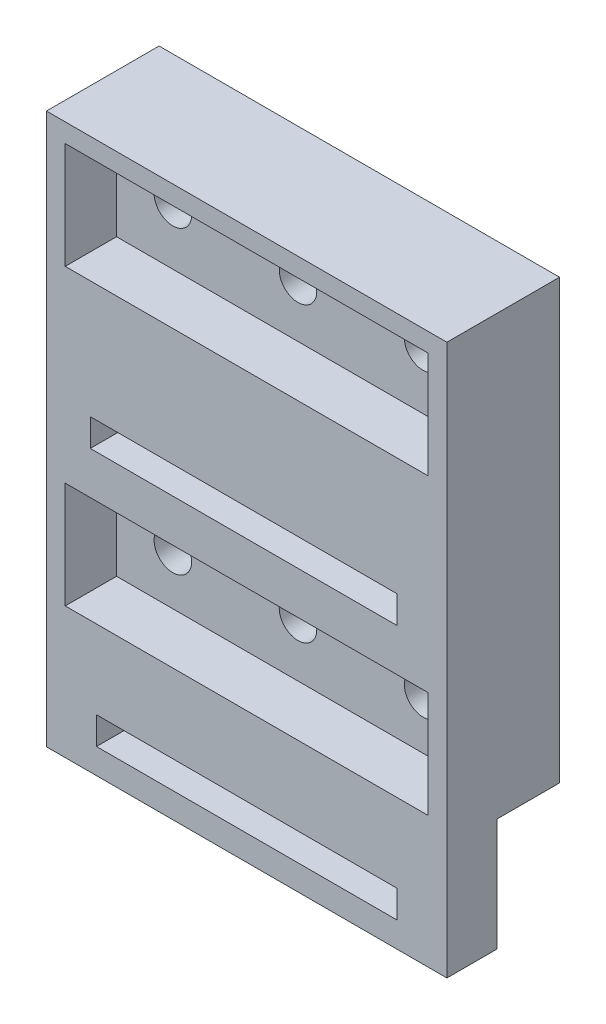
ISO-10303-21;
HEADER;
FILE_DESCRIPTION(('STEP AP214'),'2;1');
FILE_NAME('part.step','',(''),(''),'','','');
FILE_SCHEMA(('AUTOMOTIVE_DESIGN { 1 0 10303 214 1 1 1 1 }'));
ENDSEC;
DATA;
#1=APPLICATION_CONTEXT('core data for automotive mechanical design processes');
#2=APPLICATION_PROTOCOL_DEFINITION('international standard','automotive_design',2000,#1);
#3=PRODUCT_CONTEXT('',#1,'mechanical');
#4=PRODUCT('Part','Part','',(#3));
#5=PRODUCT_RELATED_PRODUCT_CATEGORY('part','',(#4));
#6=PRODUCT_DEFINITION_FORMATION('','',#4);
#7=PRODUCT_DEFINITION_CONTEXT('part definition',#1,'design');
#8=PRODUCT_DEFINITION('design','',#6,#7);
#9=PRODUCT_DEFINITION_SHAPE('','',#8);
#10=(LENGTH_UNIT() NAMED_UNIT(*) SI_UNIT(.MILLI.,.METRE.));
#11=(NAMED_UNIT(*) PLANE_ANGLE_UNIT() SI_UNIT($,.RADIAN.));
#12=(NAMED_UNIT(*) SI_UNIT($,.STERADIAN.) SOLID_ANGLE_UNIT());
#13=UNCERTAINTY_MEASURE_WITH_UNIT(LENGTH_MEASURE(1.E-05),#10,'distance_accuracy_value','');
#14=(GEOMETRIC_REPRESENTATION_CONTEXT(3) GLOBAL_UNCERTAINTY_ASSIGNED_CONTEXT((#13)) GLOBAL_UNIT_ASSIGNED_CONTEXT((#10,
#11,#12)) REPRESENTATION_CONTEXT('',''));
#15=CARTESIAN_POINT('',(0.,0.,0.));
#16=DIRECTION('',(0.,0.,1.));
#17=DIRECTION('',(1.,0.,0.));
#18=AXIS2_PLACEMENT_3D('',#15,#16,#17);
#19=CARTESIAN_POINT('',(-16.,-17.5,9.));
#20=DIRECTION('',(0.,1.,0.));
#21=DIRECTION('',(0.,0.,1.));
#22=AXIS2_PLACEMENT_3D('',#19,#20,#21);
#23=PLANE('',#22);
#24=DIRECTION('',(1.,0.,0.));
#25=VECTOR('',#24,1.);
#26=CARTESIAN_POINT('',(16.,-17.5,5.));
#27=LINE('',#26,#25);
#28=CARTESIAN_POINT('',(-16.,-17.5,5.));
#29=VERTEX_POINT('',#28);
#30=CARTESIAN_POINT('',(16.,-17.5,5.));
#31=VERTEX_POINT('',#30);
#32=EDGE_CURVE('E234',#29,#31,#27,.T.);
#33=ORIENTED_EDGE('',*,*,#32,.F.);
#34=DIRECTION('',(0.,0.,-1.));
#35=VECTOR('',#34,1.);
#36=CARTESIAN_POINT('',(-16.,-17.5,9.));
#37=LINE('',#36,#35);
#38=CARTESIAN_POINT('',(-16.,-17.5,0.));
#39=VERTEX_POINT('',#38);
#40=EDGE_CURVE('E417',#29,#39,#37,.T.);
#41=ORIENTED_EDGE('',*,*,#40,.T.);
#42=DIRECTION('',(1.,0.,0.));
#43=VECTOR('',#42,1.);
#44=CARTESIAN_POINT('',(-16.,-17.5,0.));
#45=LINE('',#44,#43);
#46=CARTESIAN_POINT('',(16.,-17.5,0.));
#47=VERTEX_POINT('',#46);
#48=EDGE_CURVE('E404',#39,#47,#45,.T.);
#49=ORIENTED_EDGE('',*,*,#48,.T.);
#50=DIRECTION('',(0.,0.,-1.));
#51=VECTOR('',#50,1.);
#52=CARTESIAN_POINT('',(16.,-17.5,9.));
#53=LINE('',#52,#51);
#54=EDGE_CURVE('E415',#31,#47,#53,.T.);
#55=ORIENTED_EDGE('',*,*,#54,.F.);
#56=EDGE_LOOP('',(#33,#41,#49,#55));
#57=FACE_BOUND('',#56,.T.);
#58=ADVANCED_FACE('F35',(#57),#23,.F.);
#59=CARTESIAN_POINT('',(-14.5,17.5,9.));
#60=DIRECTION('',(1.,0.,0.));
#61=DIRECTION('',(0.,1.,0.));
#62=AXIS2_PLACEMENT_3D('',#59,#60,#61);
#63=PLANE('',#62);
#64=DIRECTION('',(0.,-1.,0.));
#65=VECTOR('',#64,1.);
#66=CARTESIAN_POINT('',(-14.5,17.5,9.));
#67=LINE('',#66,#65);
#68=CARTESIAN_POINT('',(-14.5,16.,9.));
#69=VERTEX_POINT('',#68);
#70=CARTESIAN_POINT('',(-14.5,7.5,9.));
#71=VERTEX_POINT('',#70);
#72=EDGE_CURVE('E386',#69,#71,#67,.T.);
#73=ORIENTED_EDGE('',*,*,#72,.T.);
#74=DIRECTION('',(0.,0.,1.));
#75=VECTOR('',#74,1.);
#76=CARTESIAN_POINT('',(-14.5,7.5,9.));
#77=LINE('',#76,#75);
#78=CARTESIAN_POINT('',(-14.5,7.5,4.9));
#79=VERTEX_POINT('',#78);
#80=EDGE_CURVE('E301',#71,#79,#77,.F.);
#81=ORIENTED_EDGE('',*,*,#80,.T.);
#82=DIRECTION('',(0.,-1.,0.));
#83=VECTOR('',#82,1.);
#84=CARTESIAN_POINT('',(-14.5,17.5,4.9));
#85=LINE('',#84,#83);
#86=CARTESIAN_POINT('',(-14.5,16.,4.9));
#87=VERTEX_POINT('',#86);
#88=EDGE_CURVE('E360',#87,#79,#85,.T.);
#89=ORIENTED_EDGE('',*,*,#88,.F.);
#90=DIRECTION('',(0.,0.,-1.));
#91=VECTOR('',#90,1.);
#92=CARTESIAN_POINT('',(-14.5,16.,9.));
#93=LINE('',#92,#91);
#94=EDGE_CURVE('E369',#69,#87,#93,.T.);
#95=ORIENTED_EDGE('',*,*,#94,.F.);
#96=EDGE_LOOP('',(#73,#81,#89,#95));
#97=FACE_BOUND('',#96,.T.);
#98=ADVANCED_FACE('F455',(#97),#63,.T.);
#99=CARTESIAN_POINT('',(14.5,17.5,9.));
#100=DIRECTION('',(-1.,0.,0.));
#101=DIRECTION('',(0.,-1.,0.));
#102=AXIS2_PLACEMENT_3D('',#99,#100,#101);
#103=PLANE('',#102);
#104=DIRECTION('',(0.,1.,0.));
#105=VECTOR('',#104,1.);
#106=CARTESIAN_POINT('',(14.5,17.5,4.9));
#107=LINE('',#106,#105);
#108=CARTESIAN_POINT('',(14.5,7.5,4.9));
#109=VERTEX_POINT('',#108);
#110=CARTESIAN_POINT('',(14.5,16.,4.9));
#111=VERTEX_POINT('',#110);
#112=EDGE_CURVE('E375',#109,#111,#107,.T.);
#113=ORIENTED_EDGE('',*,*,#112,.F.);
#114=DIRECTION('',(0.,0.,1.));
#115=VECTOR('',#114,1.);
#116=CARTESIAN_POINT('',(14.5,7.5,9.));
#117=LINE('',#116,#115);
#118=CARTESIAN_POINT('',(14.5,7.5,9.));
#119=VERTEX_POINT('',#118);
#120=EDGE_CURVE('E318',#119,#109,#117,.F.);
#121=ORIENTED_EDGE('',*,*,#120,.F.);
#122=DIRECTION('',(0.,1.,0.));
#123=VECTOR('',#122,1.);
#124=CARTESIAN_POINT('',(14.5,17.5,9.));
#125=LINE('',#124,#123);
#126=CARTESIAN_POINT('',(14.5,16.,9.));
#127=VERTEX_POINT('',#126);
#128=EDGE_CURVE('E390',#119,#127,#125,.T.);
#129=ORIENTED_EDGE('',*,*,#128,.T.);
#130=DIRECTION('',(0.,0.,-1.));
#131=VECTOR('',#130,1.);
#132=CARTESIAN_POINT('',(14.5,16.,9.));
#133=LINE('',#132,#131);
#134=EDGE_CURVE('E372',#127,#111,#133,.T.);
#135=ORIENTED_EDGE('',*,*,#134,.T.);
#136=EDGE_LOOP('',(#113,#121,#129,#135));
#137=FACE_BOUND('',#136,.T.);
#138=ADVANCED_FACE('F460',(#137),#103,.T.);
#139=CARTESIAN_POINT('',(0.,0.,4.9));
#140=DIRECTION('',(0.,0.,1.));
#141=DIRECTION('',(1.,0.,0.));
#142=AXIS2_PLACEMENT_3D('',#139,#140,#141);
#143=PLANE('',#142);
#144=CARTESIAN_POINT('',(10.,12.,4.9));
#145=DIRECTION('',(0.,0.,1.));
#146=DIRECTION('',(-1.,0.,0.));
#147=AXIS2_PLACEMENT_3D('',#144,#145,#146);
#148=CIRCLE('',#147,1.5);
#149=CARTESIAN_POINT('',(8.5,12.,4.9));
#150=VERTEX_POINT('',#149);
#151=EDGE_CURVE('E317',#150,#150,#148,.T.);
#152=ORIENTED_EDGE('',*,*,#151,.F.);
#153=EDGE_LOOP('',(#152));
#154=FACE_BOUND('',#153,.T.);
#155=CARTESIAN_POINT('',(0.,11.7,4.9));
#156=DIRECTION('',(0.,0.,1.));
#157=DIRECTION('',(1.,0.,0.));
#158=AXIS2_PLACEMENT_3D('',#155,#156,#157);
#159=CIRCLE('',#158,1.5);
#160=CARTESIAN_POINT('',(1.5,11.7,4.9));
#161=VERTEX_POINT('',#160);
#162=EDGE_CURVE('E330',#161,#161,#159,.T.);
#163=ORIENTED_EDGE('',*,*,#162,.F.);
#164=EDGE_LOOP('',(#163));
#165=FACE_BOUND('',#164,.T.);
#166=CARTESIAN_POINT('',(-10.,12.,4.9));
#167=DIRECTION('',(0.,0.,1.));
#168=DIRECTION('',(-1.,0.,0.));
#169=AXIS2_PLACEMENT_3D('',#166,#167,#168);
#170=CIRCLE('',#169,1.5);
#171=CARTESIAN_POINT('',(-11.5,12.,4.9));
#172=VERTEX_POINT('',#171);
#173=EDGE_CURVE('E326',#172,#172,#170,.T.);
#174=ORIENTED_EDGE('',*,*,#173,.F.);
#175=EDGE_LOOP('',(#174));
#176=FACE_BOUND('',#175,.T.);
#177=ORIENTED_EDGE('',*,*,#88,.T.);
#178=DIRECTION('',(1.,0.,0.));
#179=VECTOR('',#178,1.);
#180=CARTESIAN_POINT('',(0.,7.5,4.9));
#181=LINE('',#180,#179);
#182=EDGE_CURVE('E419',#79,#109,#181,.T.);
#183=ORIENTED_EDGE('',*,*,#182,.T.);
#184=ORIENTED_EDGE('',*,*,#112,.T.);
#185=DIRECTION('',(-1.,0.,0.));
#186=VECTOR('',#185,1.);
#187=CARTESIAN_POINT('',(-16.,16.,4.9));
#188=LINE('',#187,#186);
#189=EDGE_CURVE('E381',#111,#87,#188,.T.);
#190=ORIENTED_EDGE('',*,*,#189,.T.);
#191=EDGE_LOOP('',(#177,#183,#184,#190));
#192=FACE_BOUND('',#191,.T.);
#193=ADVANCED_FACE('F485',(#154,#165,#176,#192),#143,.T.);
#194=CARTESIAN_POINT('',(-16.,17.5,9.));
#195=DIRECTION('',(1.,0.,0.));
#196=DIRECTION('',(0.,1.,0.));
#197=AXIS2_PLACEMENT_3D('',#194,#195,#196);
#198=PLANE('',#197);
#199=ORIENTED_EDGE('',*,*,#40,.F.);
#200=DIRECTION('',(0.,1.,0.));
#201=VECTOR('',#200,1.);
#202=CARTESIAN_POINT('',(-16.,-26.5,4.99999999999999));
#203=LINE('',#202,#201);
#204=CARTESIAN_POINT('',(-16.,-26.5,4.99999999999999));
#205=VERTEX_POINT('',#204);
#206=EDGE_CURVE('E252',#205,#29,#203,.T.);
#207=ORIENTED_EDGE('',*,*,#206,.F.);
#208=DIRECTION('',(0.,0.,-1.));
#209=VECTOR('',#208,1.);
#210=CARTESIAN_POINT('',(-16.,-26.5,9.));
#211=LINE('',#210,#209);
#212=CARTESIAN_POINT('',(-16.,-26.5,9.));
#213=VERTEX_POINT('',#212);
#214=EDGE_CURVE('E243',#213,#205,#211,.T.);
#215=ORIENTED_EDGE('',*,*,#214,.F.);
#216=DIRECTION('',(0.,-1.,0.));
#217=VECTOR('',#216,1.);
#218=CARTESIAN_POINT('',(-16.,17.5,9.));
#219=LINE('',#218,#217);
#220=CARTESIAN_POINT('',(-16.,17.5,9.));
#221=VERTEX_POINT('',#220);
#222=EDGE_CURVE('E394',#221,#213,#219,.T.);
#223=ORIENTED_EDGE('',*,*,#222,.F.);
#224=DIRECTION('',(0.,0.,-1.));
#225=VECTOR('',#224,1.);
#226=CARTESIAN_POINT('',(-16.,17.5,9.));
#227=LINE('',#226,#225);
#228=CARTESIAN_POINT('',(-16.,17.5,0.));
#229=VERTEX_POINT('',#228);
#230=EDGE_CURVE('E401',#221,#229,#227,.T.);
#231=ORIENTED_EDGE('',*,*,#230,.T.);
#232=DIRECTION('',(0.,-1.,0.));
#233=VECTOR('',#232,1.);
#234=CARTESIAN_POINT('',(-16.,17.5,0.));
#235=LINE('',#234,#233);
#236=EDGE_CURVE('E367',#229,#39,#235,.T.);
#237=ORIENTED_EDGE('',*,*,#236,.T.);
#238=EDGE_LOOP('',(#199,#207,#215,#223,#231,#237));
#239=FACE_BOUND('',#238,.T.);
#240=ADVANCED_FACE('F37',(#239),#198,.F.);
#241=CARTESIAN_POINT('',(16.,17.5,9.));
#242=DIRECTION('',(-1.,0.,0.));
#243=DIRECTION('',(0.,-1.,0.));
#244=AXIS2_PLACEMENT_3D('',#241,#242,#243);
#245=PLANE('',#244);
#246=DIRECTION('',(0.,0.,-1.));
#247=VECTOR('',#246,1.);
#248=CARTESIAN_POINT('',(16.,17.5,9.));
#249=LINE('',#248,#247);
#250=CARTESIAN_POINT('',(16.,17.5,9.));
#251=VERTEX_POINT('',#250);
#252=CARTESIAN_POINT('',(16.,17.5,0.));
#253=VERTEX_POINT('',#252);
#254=EDGE_CURVE('E412',#251,#253,#249,.T.);
#255=ORIENTED_EDGE('',*,*,#254,.F.);
#256=DIRECTION('',(0.,1.,0.));
#257=VECTOR('',#256,1.);
#258=CARTESIAN_POINT('',(16.,17.5,9.));
#259=LINE('',#258,#257);
#260=CARTESIAN_POINT('',(16.,-26.5,9.));
#261=VERTEX_POINT('',#260);
#262=EDGE_CURVE('E396',#261,#251,#259,.T.);
#263=ORIENTED_EDGE('',*,*,#262,.F.);
#264=DIRECTION('',(0.,0.,1.));
#265=VECTOR('',#264,1.);
#266=CARTESIAN_POINT('',(16.,-26.5,9.));
#267=LINE('',#266,#265);
#268=CARTESIAN_POINT('',(16.,-26.5,5.));
#269=VERTEX_POINT('',#268);
#270=EDGE_CURVE('E237',#269,#261,#267,.T.);
#271=ORIENTED_EDGE('',*,*,#270,.F.);
#272=DIRECTION('',(0.,1.,0.));
#273=VECTOR('',#272,1.);
#274=CARTESIAN_POINT('',(16.,-26.5,5.));
#275=LINE('',#274,#273);
#276=EDGE_CURVE('E247',#269,#31,#275,.T.);
#277=ORIENTED_EDGE('',*,*,#276,.T.);
#278=ORIENTED_EDGE('',*,*,#54,.T.);
#279=DIRECTION('',(0.,1.,0.));
#280=VECTOR('',#279,1.);
#281=CARTESIAN_POINT('',(16.,17.5,0.));
#282=LINE('',#281,#280);
#283=EDGE_CURVE('E407',#47,#253,#282,.T.);
#284=ORIENTED_EDGE('',*,*,#283,.T.);
#285=EDGE_LOOP('',(#255,#263,#271,#277,#278,#284));
#286=FACE_BOUND('',#285,.T.);
#287=ADVANCED_FACE('F465',(#286),#245,.F.);
#288=CARTESIAN_POINT('',(-16.,17.5,9.));
#289=DIRECTION('',(0.,-1.,0.));
#290=DIRECTION('',(0.,0.,-1.));
#291=AXIS2_PLACEMENT_3D('',#288,#289,#290);
#292=PLANE('',#291);
#293=DIRECTION('',(-1.,0.,0.));
#294=VECTOR('',#293,1.);
#295=CARTESIAN_POINT('',(-16.,17.5,0.));
#296=LINE('',#295,#294);
#297=EDGE_CURVE('E397',#253,#229,#296,.T.);
#298=ORIENTED_EDGE('',*,*,#297,.T.);
#299=ORIENTED_EDGE('',*,*,#230,.F.);
#300=DIRECTION('',(-1.,0.,0.));
#301=VECTOR('',#300,1.);
#302=CARTESIAN_POINT('',(-16.,17.5,9.));
#303=LINE('',#302,#301);
#304=EDGE_CURVE('E399',#251,#221,#303,.T.);
#305=ORIENTED_EDGE('',*,*,#304,.F.);
#306=ORIENTED_EDGE('',*,*,#254,.T.);
#307=EDGE_LOOP('',(#298,#299,#305,#306));
#308=FACE_BOUND('',#307,.T.);
#309=ADVANCED_FACE('F468',(#308),#292,.F.);
#310=CARTESIAN_POINT('',(0.,0.,9.));
#311=DIRECTION('',(0.,0.,1.));
#312=DIRECTION('',(1.,0.,0.));
#313=AXIS2_PLACEMENT_3D('',#310,#311,#312);
#314=PLANE('',#313);
#315=DIRECTION('',(0.,1.,0.));
#316=VECTOR('',#315,1.);
#317=CARTESIAN_POINT('',(12.,-24.48,9.));
#318=LINE('',#317,#316);
#319=CARTESIAN_POINT('',(12.,-24.48,9.));
#320=VERTEX_POINT('',#319);
#321=CARTESIAN_POINT('',(12.,-22.28,9.));
#322=VERTEX_POINT('',#321);
#323=EDGE_CURVE('E50',#320,#322,#318,.T.);
#324=ORIENTED_EDGE('',*,*,#323,.F.);
#325=DIRECTION('',(1.,0.,0.));
#326=VECTOR('',#325,1.);
#327=CARTESIAN_POINT('',(12.,-24.48,9.));
#328=LINE('',#327,#326);
#329=CARTESIAN_POINT('',(-12.,-24.48,9.));
#330=VERTEX_POINT('',#329);
#331=EDGE_CURVE('E227',#330,#320,#328,.T.);
#332=ORIENTED_EDGE('',*,*,#331,.F.);
#333=DIRECTION('',(0.,-1.,0.));
#334=VECTOR('',#333,1.);
#335=CARTESIAN_POINT('',(-12.,-24.48,9.));
#336=LINE('',#335,#334);
#337=CARTESIAN_POINT('',(-12.,-22.28,9.));
#338=VERTEX_POINT('',#337);
#339=EDGE_CURVE('E211',#338,#330,#336,.T.);
#340=ORIENTED_EDGE('',*,*,#339,.F.);
#341=DIRECTION('',(-1.,0.,0.));
#342=VECTOR('',#341,1.);
#343=CARTESIAN_POINT('',(12.,-22.28,9.));
#344=LINE('',#343,#342);
#345=EDGE_CURVE('E220',#322,#338,#344,.T.);
#346=ORIENTED_EDGE('',*,*,#345,.F.);
#347=EDGE_LOOP('',(#324,#332,#340,#346));
#348=FACE_BOUND('',#347,.T.);
#349=DIRECTION('',(0.,-1.,0.));
#350=VECTOR('',#349,1.);
#351=CARTESIAN_POINT('',(-12.5,0.,9.));
#352=LINE('',#351,#350);
#353=CARTESIAN_POINT('',(-12.5,-1.9,9.));
#354=VERTEX_POINT('',#353);
#355=CARTESIAN_POINT('',(-12.5,-4.1,9.));
#356=VERTEX_POINT('',#355);
#357=EDGE_CURVE('E431',#354,#356,#352,.T.);
#358=ORIENTED_EDGE('',*,*,#357,.F.);
#359=DIRECTION('',(-1.,0.,0.));
#360=VECTOR('',#359,1.);
#361=CARTESIAN_POINT('',(0.,-1.9,9.));
#362=LINE('',#361,#360);
#363=CARTESIAN_POINT('',(12.,-1.9,9.));
#364=VERTEX_POINT('',#363);
#365=EDGE_CURVE('E423',#364,#354,#362,.T.);
#366=ORIENTED_EDGE('',*,*,#365,.F.);
#367=DIRECTION('',(0.,1.,0.));
#368=VECTOR('',#367,1.);
#369=CARTESIAN_POINT('',(12.,0.,9.));
#370=LINE('',#369,#368);
#371=CARTESIAN_POINT('',(12.,-4.1,9.));
#372=VERTEX_POINT('',#371);
#373=EDGE_CURVE('E426',#372,#364,#370,.T.);
#374=ORIENTED_EDGE('',*,*,#373,.F.);
#375=DIRECTION('',(1.,0.,0.));
#376=VECTOR('',#375,1.);
#377=CARTESIAN_POINT('',(0.,-4.1,9.));
#378=LINE('',#377,#376);
#379=EDGE_CURVE('E429',#356,#372,#378,.T.);
#380=ORIENTED_EDGE('',*,*,#379,.F.);
#381=EDGE_LOOP('',(#358,#366,#374,#380));
#382=FACE_BOUND('',#381,.T.);
#383=CARTESIAN_POINT('',(-14.5,-7.5,9.));
#384=VERTEX_POINT('',#383);
#385=CARTESIAN_POINT('',(-14.5,-16.,9.));
#386=VERTEX_POINT('',#385);
#387=EDGE_CURVE('E385',#384,#386,#67,.T.);
#388=ORIENTED_EDGE('',*,*,#387,.F.);
#389=DIRECTION('',(1.,0.,0.));
#390=VECTOR('',#389,1.);
#391=CARTESIAN_POINT('',(14.5,-7.5,9.));
#392=LINE('',#391,#390);
#393=CARTESIAN_POINT('',(14.5,-7.5,9.));
#394=VERTEX_POINT('',#393);
#395=EDGE_CURVE('E310',#394,#384,#392,.F.);
#396=ORIENTED_EDGE('',*,*,#395,.F.);
#397=CARTESIAN_POINT('',(14.5,-16.,9.));
#398=VERTEX_POINT('',#397);
#399=EDGE_CURVE('E391',#398,#394,#125,.T.);
#400=ORIENTED_EDGE('',*,*,#399,.F.);
#401=DIRECTION('',(1.,0.,0.));
#402=VECTOR('',#401,1.);
#403=CARTESIAN_POINT('',(-16.,-16.,9.));
#404=LINE('',#403,#402);
#405=EDGE_CURVE('E388',#386,#398,#404,.T.);
#406=ORIENTED_EDGE('',*,*,#405,.F.);
#407=EDGE_LOOP('',(#388,#396,#400,#406));
#408=FACE_BOUND('',#407,.T.);
#409=DIRECTION('',(1.,0.,0.));
#410=VECTOR('',#409,1.);
#411=CARTESIAN_POINT('',(14.5,7.5,9.));
#412=LINE('',#411,#410);
#413=EDGE_CURVE('E314',#119,#71,#412,.F.);
#414=ORIENTED_EDGE('',*,*,#413,.T.);
#415=ORIENTED_EDGE('',*,*,#72,.F.);
#416=DIRECTION('',(-1.,0.,0.));
#417=VECTOR('',#416,1.);
#418=CARTESIAN_POINT('',(-16.,16.,9.));
#419=LINE('',#418,#417);
#420=EDGE_CURVE('E373',#127,#69,#419,.T.);
#421=ORIENTED_EDGE('',*,*,#420,.F.);
#422=ORIENTED_EDGE('',*,*,#128,.F.);
#423=EDGE_LOOP('',(#414,#415,#421,#422));
#424=FACE_BOUND('',#423,.T.);
#425=ORIENTED_EDGE('',*,*,#262,.T.);
#426=ORIENTED_EDGE('',*,*,#304,.T.);
#427=ORIENTED_EDGE('',*,*,#222,.T.);
#428=DIRECTION('',(-1.,0.,0.));
#429=VECTOR('',#428,1.);
#430=CARTESIAN_POINT('',(16.,-26.5,9.));
#431=LINE('',#430,#429);
#432=EDGE_CURVE('E240',#261,#213,#431,.T.);
#433=ORIENTED_EDGE('',*,*,#432,.F.);
#434=EDGE_LOOP('',(#425,#426,#427,#433));
#435=FACE_BOUND('',#434,.T.);
#436=ADVANCED_FACE('F224',(#348,#382,#408,#424,#435),#314,.T.);
#437=CARTESIAN_POINT('',(0.,0.,0.));
#438=DIRECTION('',(0.,0.,1.));
#439=DIRECTION('',(1.,0.,0.));
#440=AXIS2_PLACEMENT_3D('',#437,#438,#439);
#441=PLANE('',#440);
#442=DIRECTION('',(1.,0.,0.));
#443=VECTOR('',#442,1.);
#444=CARTESIAN_POINT('',(-14.,1.,0.));
#445=LINE('',#444,#443);
#446=CARTESIAN_POINT('',(-14.,1.,0.));
#447=VERTEX_POINT('',#446);
#448=CARTESIAN_POINT('',(14.,1.,0.));
#449=VERTEX_POINT('',#448);
#450=EDGE_CURVE('E291',#447,#449,#445,.T.);
#451=ORIENTED_EDGE('',*,*,#450,.F.);
#452=DIRECTION('',(0.,1.,0.));
#453=VECTOR('',#452,1.);
#454=CARTESIAN_POINT('',(-14.,-7.,0.));
#455=LINE('',#454,#453);
#456=CARTESIAN_POINT('',(-14.,-7.,0.));
#457=VERTEX_POINT('',#456);
#458=EDGE_CURVE('E269',#457,#447,#455,.T.);
#459=ORIENTED_EDGE('',*,*,#458,.F.);
#460=DIRECTION('',(-1.,0.,0.));
#461=VECTOR('',#460,1.);
#462=CARTESIAN_POINT('',(-14.,-7.,0.));
#463=LINE('',#462,#461);
#464=CARTESIAN_POINT('',(14.,-7.,0.));
#465=VERTEX_POINT('',#464);
#466=EDGE_CURVE('E280',#465,#457,#463,.T.);
#467=ORIENTED_EDGE('',*,*,#466,.F.);
#468=DIRECTION('',(0.,-1.,0.));
#469=VECTOR('',#468,1.);
#470=CARTESIAN_POINT('',(14.,-7.,0.));
#471=LINE('',#470,#469);
#472=EDGE_CURVE('E294',#449,#465,#471,.T.);
#473=ORIENTED_EDGE('',*,*,#472,.F.);
#474=EDGE_LOOP('',(#451,#459,#467,#473));
#475=FACE_BOUND('',#474,.T.);
#476=ORIENTED_EDGE('',*,*,#297,.F.);
#477=ORIENTED_EDGE('',*,*,#283,.F.);
#478=ORIENTED_EDGE('',*,*,#48,.F.);
#479=ORIENTED_EDGE('',*,*,#236,.F.);
#480=EDGE_LOOP('',(#476,#477,#478,#479));
#481=FACE_BOUND('',#480,.T.);
#482=CARTESIAN_POINT('',(-10.,12.,0.));
#483=DIRECTION('',(0.,0.,1.));
#484=DIRECTION('',(1.,0.,0.));
#485=AXIS2_PLACEMENT_3D('',#482,#483,#484);
#486=CIRCLE('',#485,1.5);
#487=CARTESIAN_POINT('',(-8.5,12.,0.));
#488=VERTEX_POINT('',#487);
#489=EDGE_CURVE('E356',#488,#488,#486,.T.);
#490=ORIENTED_EDGE('',*,*,#489,.T.);
#491=EDGE_LOOP('',(#490));
#492=FACE_BOUND('',#491,.T.);
#493=CARTESIAN_POINT('',(0.,11.7,0.));
#494=DIRECTION('',(0.,0.,1.));
#495=DIRECTION('',(1.,0.,0.));
#496=AXIS2_PLACEMENT_3D('',#493,#494,#495);
#497=CIRCLE('',#496,1.5);
#498=CARTESIAN_POINT('',(1.5,11.7,0.));
#499=VERTEX_POINT('',#498);
#500=EDGE_CURVE('E350',#499,#499,#497,.T.);
#501=ORIENTED_EDGE('',*,*,#500,.T.);
#502=EDGE_LOOP('',(#501));
#503=FACE_BOUND('',#502,.T.);
#504=CARTESIAN_POINT('',(10.,12.,0.));
#505=DIRECTION('',(0.,0.,1.));
#506=DIRECTION('',(1.,0.,0.));
#507=AXIS2_PLACEMENT_3D('',#504,#505,#506);
#508=CIRCLE('',#507,1.5);
#509=CARTESIAN_POINT('',(11.5,12.,0.));
#510=VERTEX_POINT('',#509);
#511=EDGE_CURVE('E344',#510,#510,#508,.T.);
#512=ORIENTED_EDGE('',*,*,#511,.T.);
#513=EDGE_LOOP('',(#512));
#514=FACE_BOUND('',#513,.T.);
#515=CARTESIAN_POINT('',(0.,-11.7,0.));
#516=DIRECTION('',(0.,0.,1.));
#517=DIRECTION('',(1.,0.,0.));
#518=AXIS2_PLACEMENT_3D('',#515,#516,#517);
#519=CIRCLE('',#518,1.5);
#520=CARTESIAN_POINT('',(1.5,-11.7,0.));
#521=VERTEX_POINT('',#520);
#522=EDGE_CURVE('E353',#521,#521,#519,.T.);
#523=ORIENTED_EDGE('',*,*,#522,.T.);
#524=EDGE_LOOP('',(#523));
#525=FACE_BOUND('',#524,.T.);
#526=CARTESIAN_POINT('',(10.,-12.,0.));
#527=DIRECTION('',(0.,0.,1.));
#528=DIRECTION('',(1.,0.,0.));
#529=AXIS2_PLACEMENT_3D('',#526,#527,#528);
#530=CIRCLE('',#529,1.5);
#531=CARTESIAN_POINT('',(11.5,-12.,0.));
#532=VERTEX_POINT('',#531);
#533=EDGE_CURVE('E347',#532,#532,#530,.T.);
#534=ORIENTED_EDGE('',*,*,#533,.T.);
#535=EDGE_LOOP('',(#534));
#536=FACE_BOUND('',#535,.T.);
#537=CARTESIAN_POINT('',(-10.,-12.,0.));
#538=DIRECTION('',(0.,0.,1.));
#539=DIRECTION('',(1.,0.,0.));
#540=AXIS2_PLACEMENT_3D('',#537,#538,#539);
#541=CIRCLE('',#540,1.5);
#542=CARTESIAN_POINT('',(-8.5,-12.,0.));
#543=VERTEX_POINT('',#542);
#544=EDGE_CURVE('E341',#543,#543,#541,.T.);
#545=ORIENTED_EDGE('',*,*,#544,.T.);
#546=EDGE_LOOP('',(#545));
#547=FACE_BOUND('',#546,.T.);
#548=ADVANCED_FACE('F473',(#475,#481,#492,#503,#514,#525,#536,#547),#441,.F.);
#549=DIRECTION('',(0.,0.,1.));
#550=VECTOR('',#549,1.);
#551=CARTESIAN_POINT('',(-14.5,-7.5,9.));
#552=LINE('',#551,#550);
#553=CARTESIAN_POINT('',(-14.5,-7.5,4.9));
#554=VERTEX_POINT('',#553);
#555=EDGE_CURVE('E311',#384,#554,#552,.F.);
#556=ORIENTED_EDGE('',*,*,#555,.F.);
#557=ORIENTED_EDGE('',*,*,#387,.T.);
#558=DIRECTION('',(0.,0.,-1.));
#559=VECTOR('',#558,1.);
#560=CARTESIAN_POINT('',(-14.5,-16.,9.));
#561=LINE('',#560,#559);
#562=CARTESIAN_POINT('',(-14.5,-16.,4.9));
#563=VERTEX_POINT('',#562);
#564=EDGE_CURVE('E364',#386,#563,#561,.T.);
#565=ORIENTED_EDGE('',*,*,#564,.T.);
#566=EDGE_CURVE('E359',#554,#563,#85,.T.);
#567=ORIENTED_EDGE('',*,*,#566,.F.);
#568=EDGE_LOOP('',(#556,#557,#565,#567));
#569=FACE_BOUND('',#568,.T.);
#570=ADVANCED_FACE('F463',(#569),#63,.T.);
#571=CARTESIAN_POINT('',(-16.,-16.,9.));
#572=DIRECTION('',(0.,1.,0.));
#573=DIRECTION('',(0.,0.,1.));
#574=AXIS2_PLACEMENT_3D('',#571,#572,#573);
#575=PLANE('',#574);
#576=DIRECTION('',(1.,0.,0.));
#577=VECTOR('',#576,1.);
#578=CARTESIAN_POINT('',(-16.,-16.,4.9));
#579=LINE('',#578,#577);
#580=CARTESIAN_POINT('',(14.5,-16.,4.9));
#581=VERTEX_POINT('',#580);
#582=EDGE_CURVE('E363',#563,#581,#579,.T.);
#583=ORIENTED_EDGE('',*,*,#582,.F.);
#584=ORIENTED_EDGE('',*,*,#564,.F.);
#585=ORIENTED_EDGE('',*,*,#405,.T.);
#586=DIRECTION('',(0.,0.,-1.));
#587=VECTOR('',#586,1.);
#588=CARTESIAN_POINT('',(14.5,-16.,9.));
#589=LINE('',#588,#587);
#590=EDGE_CURVE('E368',#398,#581,#589,.T.);
#591=ORIENTED_EDGE('',*,*,#590,.T.);
#592=EDGE_LOOP('',(#583,#584,#585,#591));
#593=FACE_BOUND('',#592,.T.);
#594=ADVANCED_FACE('F492',(#593),#575,.T.);
#595=DIRECTION('',(0.,0.,1.));
#596=VECTOR('',#595,1.);
#597=CARTESIAN_POINT('',(14.5,-7.5,9.));
#598=LINE('',#597,#596);
#599=CARTESIAN_POINT('',(14.5,-7.5,4.9));
#600=VERTEX_POINT('',#599);
#601=EDGE_CURVE('E308',#394,#600,#598,.F.);
#602=ORIENTED_EDGE('',*,*,#601,.T.);
#603=EDGE_CURVE('E378',#581,#600,#107,.T.);
#604=ORIENTED_EDGE('',*,*,#603,.F.);
#605=ORIENTED_EDGE('',*,*,#590,.F.);
#606=ORIENTED_EDGE('',*,*,#399,.T.);
#607=EDGE_LOOP('',(#602,#604,#605,#606));
#608=FACE_BOUND('',#607,.T.);
#609=ADVANCED_FACE('F488',(#608),#103,.T.);
#610=CARTESIAN_POINT('',(-16.,16.,9.));
#611=DIRECTION('',(0.,-1.,0.));
#612=DIRECTION('',(0.,0.,-1.));
#613=AXIS2_PLACEMENT_3D('',#610,#611,#612);
#614=PLANE('',#613);
#615=ORIENTED_EDGE('',*,*,#189,.F.);
#616=ORIENTED_EDGE('',*,*,#134,.F.);
#617=ORIENTED_EDGE('',*,*,#420,.T.);
#618=ORIENTED_EDGE('',*,*,#94,.T.);
#619=EDGE_LOOP('',(#615,#616,#617,#618));
#620=FACE_BOUND('',#619,.T.);
#621=ADVANCED_FACE('F483',(#620),#614,.T.);
#622=DIRECTION('',(1.,0.,0.));
#623=VECTOR('',#622,1.);
#624=CARTESIAN_POINT('',(0.,-7.5,4.9));
#625=LINE('',#624,#623);
#626=EDGE_CURVE('E420',#554,#600,#625,.T.);
#627=ORIENTED_EDGE('',*,*,#626,.F.);
#628=ORIENTED_EDGE('',*,*,#566,.T.);
#629=ORIENTED_EDGE('',*,*,#582,.T.);
#630=ORIENTED_EDGE('',*,*,#603,.T.);
#631=EDGE_LOOP('',(#627,#628,#629,#630));
#632=FACE_BOUND('',#631,.T.);
#633=CARTESIAN_POINT('',(0.,-11.7,4.9));
#634=DIRECTION('',(0.,0.,1.));
#635=DIRECTION('',(-1.,0.,0.));
#636=AXIS2_PLACEMENT_3D('',#633,#634,#635);
#637=CIRCLE('',#636,1.5);
#638=CARTESIAN_POINT('',(-1.5,-11.7,4.9));
#639=VERTEX_POINT('',#638);
#640=EDGE_CURVE('E327',#639,#639,#637,.T.);
#641=ORIENTED_EDGE('',*,*,#640,.F.);
#642=EDGE_LOOP('',(#641));
#643=FACE_BOUND('',#642,.T.);
#644=CARTESIAN_POINT('',(10.,-12.,4.9));
#645=DIRECTION('',(0.,0.,1.));
#646=DIRECTION('',(1.,0.,0.));
#647=AXIS2_PLACEMENT_3D('',#644,#645,#646);
#648=CIRCLE('',#647,1.5);
#649=CARTESIAN_POINT('',(11.5,-12.,4.9));
#650=VERTEX_POINT('',#649);
#651=EDGE_CURVE('E333',#650,#650,#648,.T.);
#652=ORIENTED_EDGE('',*,*,#651,.F.);
#653=EDGE_LOOP('',(#652));
#654=FACE_BOUND('',#653,.T.);
#655=CARTESIAN_POINT('',(-10.,-12.,4.9));
#656=DIRECTION('',(0.,0.,1.));
#657=DIRECTION('',(1.,0.,0.));
#658=AXIS2_PLACEMENT_3D('',#655,#656,#657);
#659=CIRCLE('',#658,1.5);
#660=CARTESIAN_POINT('',(-8.5,-12.,4.9));
#661=VERTEX_POINT('',#660);
#662=EDGE_CURVE('E336',#661,#661,#659,.T.);
#663=ORIENTED_EDGE('',*,*,#662,.F.);
#664=EDGE_LOOP('',(#663));
#665=FACE_BOUND('',#664,.T.);
#666=ADVANCED_FACE('F479',(#632,#643,#654,#665),#143,.T.);
#667=CARTESIAN_POINT('',(-10.,-12.,-4.1));
#668=DIRECTION('',(0.,0.,1.));
#669=DIRECTION('',(1.,0.,0.));
#670=AXIS2_PLACEMENT_3D('',#667,#668,#669);
#671=CYLINDRICAL_SURFACE('',#670,1.5);
#672=ORIENTED_EDGE('',*,*,#662,.T.);
#673=EDGE_LOOP('',(#672));
#674=FACE_BOUND('',#673,.T.);
#675=ORIENTED_EDGE('',*,*,#544,.F.);
#676=EDGE_LOOP('',(#675));
#677=FACE_BOUND('',#676,.T.);
#678=ADVANCED_FACE('F482',(#674,#677),#671,.F.);
#679=CARTESIAN_POINT('',(10.,12.,-4.1));
#680=DIRECTION('',(0.,0.,1.));
#681=DIRECTION('',(1.,0.,0.));
#682=AXIS2_PLACEMENT_3D('',#679,#680,#681);
#683=CYLINDRICAL_SURFACE('',#682,1.5);
#684=ORIENTED_EDGE('',*,*,#151,.T.);
#685=EDGE_LOOP('',(#684));
#686=FACE_BOUND('',#685,.T.);
#687=ORIENTED_EDGE('',*,*,#511,.F.);
#688=EDGE_LOOP('',(#687));
#689=FACE_BOUND('',#688,.T.);
#690=ADVANCED_FACE('F501',(#686,#689),#683,.F.);
#691=CARTESIAN_POINT('',(10.,-12.,-4.1));
#692=DIRECTION('',(0.,0.,1.));
#693=DIRECTION('',(1.,0.,0.));
#694=AXIS2_PLACEMENT_3D('',#691,#692,#693);
#695=CYLINDRICAL_SURFACE('',#694,1.5);
#696=ORIENTED_EDGE('',*,*,#651,.T.);
#697=EDGE_LOOP('',(#696));
#698=FACE_BOUND('',#697,.T.);
#699=ORIENTED_EDGE('',*,*,#533,.F.);
#700=EDGE_LOOP('',(#699));
#701=FACE_BOUND('',#700,.T.);
#702=ADVANCED_FACE('F507',(#698,#701),#695,.F.);
#703=CARTESIAN_POINT('',(0.,11.7,-4.1));
#704=DIRECTION('',(0.,0.,1.));
#705=DIRECTION('',(1.,0.,0.));
#706=AXIS2_PLACEMENT_3D('',#703,#704,#705);
#707=CYLINDRICAL_SURFACE('',#706,1.5);
#708=ORIENTED_EDGE('',*,*,#162,.T.);
#709=EDGE_LOOP('',(#708));
#710=FACE_BOUND('',#709,.T.);
#711=ORIENTED_EDGE('',*,*,#500,.F.);
#712=EDGE_LOOP('',(#711));
#713=FACE_BOUND('',#712,.T.);
#714=ADVANCED_FACE('F503',(#710,#713),#707,.F.);
#715=CARTESIAN_POINT('',(0.,-11.7,-4.1));
#716=DIRECTION('',(0.,0.,1.));
#717=DIRECTION('',(1.,0.,0.));
#718=AXIS2_PLACEMENT_3D('',#715,#716,#717);
#719=CYLINDRICAL_SURFACE('',#718,1.5);
#720=ORIENTED_EDGE('',*,*,#640,.T.);
#721=EDGE_LOOP('',(#720));
#722=FACE_BOUND('',#721,.T.);
#723=ORIENTED_EDGE('',*,*,#522,.F.);
#724=EDGE_LOOP('',(#723));
#725=FACE_BOUND('',#724,.T.);
#726=ADVANCED_FACE('F506',(#722,#725),#719,.F.);
#727=CARTESIAN_POINT('',(-10.,12.,-4.1));
#728=DIRECTION('',(0.,0.,1.));
#729=DIRECTION('',(1.,0.,0.));
#730=AXIS2_PLACEMENT_3D('',#727,#728,#729);
#731=CYLINDRICAL_SURFACE('',#730,1.5);
#732=ORIENTED_EDGE('',*,*,#173,.T.);
#733=EDGE_LOOP('',(#732));
#734=FACE_BOUND('',#733,.T.);
#735=ORIENTED_EDGE('',*,*,#489,.F.);
#736=EDGE_LOOP('',(#735));
#737=FACE_BOUND('',#736,.T.);
#738=ADVANCED_FACE('F512',(#734,#737),#731,.F.);
#739=CARTESIAN_POINT('',(14.5,-7.5,9.));
#740=DIRECTION('',(0.,-1.,0.));
#741=DIRECTION('',(1.,0.,0.));
#742=AXIS2_PLACEMENT_3D('',#739,#740,#741);
#743=PLANE('',#742);
#744=ORIENTED_EDGE('',*,*,#555,.T.);
#745=ORIENTED_EDGE('',*,*,#626,.T.);
#746=ORIENTED_EDGE('',*,*,#601,.F.);
#747=ORIENTED_EDGE('',*,*,#395,.T.);
#748=EDGE_LOOP('',(#744,#745,#746,#747));
#749=FACE_BOUND('',#748,.T.);
#750=ADVANCED_FACE('F515',(#749),#743,.T.);
#751=CARTESIAN_POINT('',(14.5,7.5,9.));
#752=DIRECTION('',(0.,-1.,0.));
#753=DIRECTION('',(1.,0.,0.));
#754=AXIS2_PLACEMENT_3D('',#751,#752,#753);
#755=PLANE('',#754);
#756=ORIENTED_EDGE('',*,*,#182,.F.);
#757=ORIENTED_EDGE('',*,*,#80,.F.);
#758=ORIENTED_EDGE('',*,*,#413,.F.);
#759=ORIENTED_EDGE('',*,*,#120,.T.);
#760=EDGE_LOOP('',(#756,#757,#758,#759));
#761=FACE_BOUND('',#760,.T.);
#762=ADVANCED_FACE('F523',(#761),#755,.F.);
#763=CARTESIAN_POINT('',(-14.,-7.,5.));
#764=DIRECTION('',(-1.,0.,0.));
#765=DIRECTION('',(0.,-1.,0.));
#766=AXIS2_PLACEMENT_3D('',#763,#764,#765);
#767=PLANE('',#766);
#768=ORIENTED_EDGE('',*,*,#458,.T.);
#769=DIRECTION('',(0.,0.,-1.));
#770=VECTOR('',#769,1.);
#771=CARTESIAN_POINT('',(-14.,1.,5.));
#772=LINE('',#771,#770);
#773=CARTESIAN_POINT('',(-14.,1.,5.));
#774=VERTEX_POINT('',#773);
#775=EDGE_CURVE('E289',#774,#447,#772,.T.);
#776=ORIENTED_EDGE('',*,*,#775,.F.);
#777=DIRECTION('',(0.,1.,0.));
#778=VECTOR('',#777,1.);
#779=CARTESIAN_POINT('',(-14.,-7.,5.));
#780=LINE('',#779,#778);
#781=CARTESIAN_POINT('',(-14.,-7.,5.));
#782=VERTEX_POINT('',#781);
#783=EDGE_CURVE('E276',#782,#774,#780,.T.);
#784=ORIENTED_EDGE('',*,*,#783,.F.);
#785=DIRECTION('',(0.,0.,-1.));
#786=VECTOR('',#785,1.);
#787=CARTESIAN_POINT('',(-14.,-7.,5.));
#788=LINE('',#787,#786);
#789=EDGE_CURVE('E299',#782,#457,#788,.T.);
#790=ORIENTED_EDGE('',*,*,#789,.T.);
#791=EDGE_LOOP('',(#768,#776,#784,#790));
#792=FACE_BOUND('',#791,.T.);
#793=ADVANCED_FACE('F526',(#792),#767,.F.);
#794=CARTESIAN_POINT('',(-14.,-7.,5.));
#795=DIRECTION('',(0.,-1.,0.));
#796=DIRECTION('',(1.,0.,0.));
#797=AXIS2_PLACEMENT_3D('',#794,#795,#796);
#798=PLANE('',#797);
#799=ORIENTED_EDGE('',*,*,#466,.T.);
#800=ORIENTED_EDGE('',*,*,#789,.F.);
#801=DIRECTION('',(-1.,0.,0.));
#802=VECTOR('',#801,1.);
#803=CARTESIAN_POINT('',(-14.,-7.,5.));
#804=LINE('',#803,#802);
#805=CARTESIAN_POINT('',(14.,-7.,5.));
#806=VERTEX_POINT('',#805);
#807=EDGE_CURVE('E286',#806,#782,#804,.T.);
#808=ORIENTED_EDGE('',*,*,#807,.F.);
#809=DIRECTION('',(0.,0.,-1.));
#810=VECTOR('',#809,1.);
#811=CARTESIAN_POINT('',(14.,-7.,5.));
#812=LINE('',#811,#810);
#813=EDGE_CURVE('E302',#806,#465,#812,.T.);
#814=ORIENTED_EDGE('',*,*,#813,.T.);
#815=EDGE_LOOP('',(#799,#800,#808,#814));
#816=FACE_BOUND('',#815,.T.);
#817=ADVANCED_FACE('F533',(#816),#798,.F.);
#818=CARTESIAN_POINT('',(14.,-7.,5.));
#819=DIRECTION('',(1.,0.,0.));
#820=DIRECTION('',(0.,1.,0.));
#821=AXIS2_PLACEMENT_3D('',#818,#819,#820);
#822=PLANE('',#821);
#823=ORIENTED_EDGE('',*,*,#472,.T.);
#824=ORIENTED_EDGE('',*,*,#813,.F.);
#825=DIRECTION('',(0.,-1.,0.));
#826=VECTOR('',#825,1.);
#827=CARTESIAN_POINT('',(14.,-7.,5.));
#828=LINE('',#827,#826);
#829=CARTESIAN_POINT('',(14.,1.,5.));
#830=VERTEX_POINT('',#829);
#831=EDGE_CURVE('E283',#830,#806,#828,.T.);
#832=ORIENTED_EDGE('',*,*,#831,.F.);
#833=DIRECTION('',(0.,0.,-1.));
#834=VECTOR('',#833,1.);
#835=CARTESIAN_POINT('',(14.,1.,5.));
#836=LINE('',#835,#834);
#837=EDGE_CURVE('E304',#830,#449,#836,.T.);
#838=ORIENTED_EDGE('',*,*,#837,.T.);
#839=EDGE_LOOP('',(#823,#824,#832,#838));
#840=FACE_BOUND('',#839,.T.);
#841=ADVANCED_FACE('F539',(#840),#822,.F.);
#842=CARTESIAN_POINT('',(-14.,1.,5.));
#843=DIRECTION('',(0.,1.,0.));
#844=DIRECTION('',(-1.,0.,0.));
#845=AXIS2_PLACEMENT_3D('',#842,#843,#844);
#846=PLANE('',#845);
#847=ORIENTED_EDGE('',*,*,#450,.T.);
#848=ORIENTED_EDGE('',*,*,#837,.F.);
#849=DIRECTION('',(1.,0.,0.));
#850=VECTOR('',#849,1.);
#851=CARTESIAN_POINT('',(-14.,1.,5.));
#852=LINE('',#851,#850);
#853=EDGE_CURVE('E279',#774,#830,#852,.T.);
#854=ORIENTED_EDGE('',*,*,#853,.F.);
#855=ORIENTED_EDGE('',*,*,#775,.T.);
#856=EDGE_LOOP('',(#847,#848,#854,#855));
#857=FACE_BOUND('',#856,.T.);
#858=ADVANCED_FACE('F535',(#857),#846,.F.);
#859=CARTESIAN_POINT('',(0.,0.,5.));
#860=DIRECTION('',(0.,0.,-1.));
#861=DIRECTION('',(-1.,0.,0.));
#862=AXIS2_PLACEMENT_3D('',#859,#860,#861);
#863=PLANE('',#862);
#864=DIRECTION('',(0.,1.,0.));
#865=VECTOR('',#864,1.);
#866=CARTESIAN_POINT('',(-12.5,-1.9,5.));
#867=LINE('',#866,#865);
#868=CARTESIAN_POINT('',(-12.5,-4.1,5.));
#869=VERTEX_POINT('',#868);
#870=CARTESIAN_POINT('',(-12.5,-1.9,5.));
#871=VERTEX_POINT('',#870);
#872=EDGE_CURVE('E255',#869,#871,#867,.T.);
#873=ORIENTED_EDGE('',*,*,#872,.F.);
#874=DIRECTION('',(-1.,0.,0.));
#875=VECTOR('',#874,1.);
#876=CARTESIAN_POINT('',(-12.5,-4.1,5.));
#877=LINE('',#876,#875);
#878=CARTESIAN_POINT('',(12.,-4.1,5.));
#879=VERTEX_POINT('',#878);
#880=EDGE_CURVE('E263',#879,#869,#877,.T.);
#881=ORIENTED_EDGE('',*,*,#880,.F.);
#882=DIRECTION('',(0.,-1.,0.));
#883=VECTOR('',#882,1.);
#884=CARTESIAN_POINT('',(12.,-1.9,5.));
#885=LINE('',#884,#883);
#886=CARTESIAN_POINT('',(12.,-1.9,5.));
#887=VERTEX_POINT('',#886);
#888=EDGE_CURVE('E261',#887,#879,#885,.T.);
#889=ORIENTED_EDGE('',*,*,#888,.F.);
#890=DIRECTION('',(1.,0.,0.));
#891=VECTOR('',#890,1.);
#892=CARTESIAN_POINT('',(-12.5,-1.9,5.));
#893=LINE('',#892,#891);
#894=EDGE_CURVE('E258',#871,#887,#893,.T.);
#895=ORIENTED_EDGE('',*,*,#894,.F.);
#896=EDGE_LOOP('',(#873,#881,#889,#895));
#897=FACE_BOUND('',#896,.T.);
#898=ORIENTED_EDGE('',*,*,#783,.T.);
#899=ORIENTED_EDGE('',*,*,#853,.T.);
#900=ORIENTED_EDGE('',*,*,#831,.T.);
#901=ORIENTED_EDGE('',*,*,#807,.T.);
#902=EDGE_LOOP('',(#898,#899,#900,#901));
#903=FACE_BOUND('',#902,.T.);
#904=ADVANCED_FACE('F538',(#897,#903),#863,.T.);
#905=CARTESIAN_POINT('',(-12.5,-1.9,15.));
#906=DIRECTION('',(-1.,0.,0.));
#907=DIRECTION('',(0.,0.,1.));
#908=AXIS2_PLACEMENT_3D('',#905,#906,#907);
#909=PLANE('',#908);
#910=ORIENTED_EDGE('',*,*,#357,.T.);
#911=DIRECTION('',(0.,0.,-1.));
#912=VECTOR('',#911,1.);
#913=CARTESIAN_POINT('',(-12.5,-4.1,15.));
#914=LINE('',#913,#912);
#915=EDGE_CURVE('E267',#356,#869,#914,.T.);
#916=ORIENTED_EDGE('',*,*,#915,.T.);
#917=ORIENTED_EDGE('',*,*,#872,.T.);
#918=DIRECTION('',(0.,0.,-1.));
#919=VECTOR('',#918,1.);
#920=CARTESIAN_POINT('',(-12.5,-1.9,15.));
#921=LINE('',#920,#919);
#922=EDGE_CURVE('E266',#354,#871,#921,.T.);
#923=ORIENTED_EDGE('',*,*,#922,.F.);
#924=EDGE_LOOP('',(#910,#916,#917,#923));
#925=FACE_BOUND('',#924,.T.);
#926=ADVANCED_FACE('F549',(#925),#909,.F.);
#927=CARTESIAN_POINT('',(-12.5,-4.1,15.));
#928=DIRECTION('',(0.,-1.,0.));
#929=DIRECTION('',(1.,0.,0.));
#930=AXIS2_PLACEMENT_3D('',#927,#928,#929);
#931=PLANE('',#930);
#932=ORIENTED_EDGE('',*,*,#379,.T.);
#933=DIRECTION('',(0.,0.,-1.));
#934=VECTOR('',#933,1.);
#935=CARTESIAN_POINT('',(12.,-4.1,15.));
#936=LINE('',#935,#934);
#937=EDGE_CURVE('E270',#372,#879,#936,.T.);
#938=ORIENTED_EDGE('',*,*,#937,.T.);
#939=ORIENTED_EDGE('',*,*,#880,.T.);
#940=ORIENTED_EDGE('',*,*,#915,.F.);
#941=EDGE_LOOP('',(#932,#938,#939,#940));
#942=FACE_BOUND('',#941,.T.);
#943=ADVANCED_FACE('F553',(#942),#931,.F.);
#944=CARTESIAN_POINT('',(12.,-1.9,15.));
#945=DIRECTION('',(1.,0.,0.));
#946=DIRECTION('',(0.,0.,-1.));
#947=AXIS2_PLACEMENT_3D('',#944,#945,#946);
#948=PLANE('',#947);
#949=ORIENTED_EDGE('',*,*,#373,.T.);
#950=DIRECTION('',(0.,0.,-1.));
#951=VECTOR('',#950,1.);
#952=CARTESIAN_POINT('',(12.,-1.9,15.));
#953=LINE('',#952,#951);
#954=EDGE_CURVE('E273',#364,#887,#953,.T.);
#955=ORIENTED_EDGE('',*,*,#954,.T.);
#956=ORIENTED_EDGE('',*,*,#888,.T.);
#957=ORIENTED_EDGE('',*,*,#937,.F.);
#958=EDGE_LOOP('',(#949,#955,#956,#957));
#959=FACE_BOUND('',#958,.T.);
#960=ADVANCED_FACE('F558',(#959),#948,.F.);
#961=CARTESIAN_POINT('',(-12.5,-1.9,15.));
#962=DIRECTION('',(0.,1.,0.));
#963=DIRECTION('',(-1.,0.,0.));
#964=AXIS2_PLACEMENT_3D('',#961,#962,#963);
#965=PLANE('',#964);
#966=ORIENTED_EDGE('',*,*,#365,.T.);
#967=ORIENTED_EDGE('',*,*,#922,.T.);
#968=ORIENTED_EDGE('',*,*,#894,.T.);
#969=ORIENTED_EDGE('',*,*,#954,.F.);
#970=EDGE_LOOP('',(#966,#967,#968,#969));
#971=FACE_BOUND('',#970,.T.);
#972=ADVANCED_FACE('F555',(#971),#965,.F.);
#973=CARTESIAN_POINT('',(16.,-26.5,5.));
#974=DIRECTION('',(0.,0.,1.));
#975=DIRECTION('',(1.,0.,0.));
#976=AXIS2_PLACEMENT_3D('',#973,#974,#975);
#977=PLANE('',#976);
#978=DIRECTION('',(1.,0.,0.));
#979=VECTOR('',#978,1.);
#980=CARTESIAN_POINT('',(16.,-24.48,5.));
#981=LINE('',#980,#979);
#982=CARTESIAN_POINT('',(-12.,-24.48,5.));
#983=VERTEX_POINT('',#982);
#984=CARTESIAN_POINT('',(12.,-24.48,5.));
#985=VERTEX_POINT('',#984);
#986=EDGE_CURVE('E43',#983,#985,#981,.T.);
#987=ORIENTED_EDGE('',*,*,#986,.T.);
#988=DIRECTION('',(0.,1.,0.));
#989=VECTOR('',#988,1.);
#990=CARTESIAN_POINT('',(12.,-26.5,5.));
#991=LINE('',#990,#989);
#992=CARTESIAN_POINT('',(12.,-22.28,5.));
#993=VERTEX_POINT('',#992);
#994=EDGE_CURVE('E12',#985,#993,#991,.T.);
#995=ORIENTED_EDGE('',*,*,#994,.T.);
#996=DIRECTION('',(-1.,0.,0.));
#997=VECTOR('',#996,1.);
#998=CARTESIAN_POINT('',(16.,-22.28,5.));
#999=LINE('',#998,#997);
#1000=CARTESIAN_POINT('',(-12.,-22.28,5.));
#1001=VERTEX_POINT('',#1000);
#1002=EDGE_CURVE('E433',#993,#1001,#999,.T.);
#1003=ORIENTED_EDGE('',*,*,#1002,.T.);
#1004=DIRECTION('',(0.,-1.,0.));
#1005=VECTOR('',#1004,1.);
#1006=CARTESIAN_POINT('',(-12.,-26.5,5.));
#1007=LINE('',#1006,#1005);
#1008=EDGE_CURVE('E214',#1001,#983,#1007,.T.);
#1009=ORIENTED_EDGE('',*,*,#1008,.T.);
#1010=EDGE_LOOP('',(#987,#995,#1003,#1009));
#1011=FACE_BOUND('',#1010,.T.);
#1012=ORIENTED_EDGE('',*,*,#32,.T.);
#1013=ORIENTED_EDGE('',*,*,#276,.F.);
#1014=DIRECTION('',(1.,0.,0.));
#1015=VECTOR('',#1014,1.);
#1016=CARTESIAN_POINT('',(16.,-26.5,5.));
#1017=LINE('',#1016,#1015);
#1018=EDGE_CURVE('E245',#205,#269,#1017,.T.);
#1019=ORIENTED_EDGE('',*,*,#1018,.F.);
#1020=ORIENTED_EDGE('',*,*,#206,.T.);
#1021=EDGE_LOOP('',(#1012,#1013,#1019,#1020));
#1022=FACE_BOUND('',#1021,.T.);
#1023=ADVANCED_FACE('F437',(#1011,#1022),#977,.F.);
#1024=CARTESIAN_POINT('',(0.,-26.5,0.));
#1025=DIRECTION('',(0.,1.,0.));
#1026=DIRECTION('',(0.,0.,1.));
#1027=AXIS2_PLACEMENT_3D('',#1024,#1025,#1026);
#1028=PLANE('',#1027);
#1029=ORIENTED_EDGE('',*,*,#270,.T.);
#1030=ORIENTED_EDGE('',*,*,#432,.T.);
#1031=ORIENTED_EDGE('',*,*,#214,.T.);
#1032=ORIENTED_EDGE('',*,*,#1018,.T.);
#1033=EDGE_LOOP('',(#1029,#1030,#1031,#1032));
#1034=FACE_BOUND('',#1033,.T.);
#1035=ADVANCED_FACE('F444',(#1034),#1028,.F.);
#1036=CARTESIAN_POINT('',(12.,-24.48,-1.));
#1037=DIRECTION('',(1.,0.,0.));
#1038=DIRECTION('',(0.,0.,-1.));
#1039=AXIS2_PLACEMENT_3D('',#1036,#1037,#1038);
#1040=PLANE('',#1039);
#1041=DIRECTION('',(0.,0.,1.));
#1042=VECTOR('',#1041,1.);
#1043=CARTESIAN_POINT('',(12.,-24.48,-1.));
#1044=LINE('',#1043,#1042);
#1045=EDGE_CURVE('E232',#985,#320,#1044,.T.);
#1046=ORIENTED_EDGE('',*,*,#1045,.T.);
#1047=ORIENTED_EDGE('',*,*,#323,.T.);
#1048=DIRECTION('',(0.,0.,1.));
#1049=VECTOR('',#1048,1.);
#1050=CARTESIAN_POINT('',(12.,-22.28,-1.));
#1051=LINE('',#1050,#1049);
#1052=EDGE_CURVE('E217',#993,#322,#1051,.T.);
#1053=ORIENTED_EDGE('',*,*,#1052,.F.);
#1054=ORIENTED_EDGE('',*,*,#994,.F.);
#1055=EDGE_LOOP('',(#1046,#1047,#1053,#1054));
#1056=FACE_BOUND('',#1055,.T.);
#1057=ADVANCED_FACE('F442',(#1056),#1040,.F.);
#1058=CARTESIAN_POINT('',(12.,-24.48,-1.));
#1059=DIRECTION('',(0.,-1.,0.));
#1060=DIRECTION('',(1.,0.,0.));
#1061=AXIS2_PLACEMENT_3D('',#1058,#1059,#1060);
#1062=PLANE('',#1061);
#1063=DIRECTION('',(0.,0.,1.));
#1064=VECTOR('',#1063,1.);
#1065=CARTESIAN_POINT('',(-12.,-24.48,-1.));
#1066=LINE('',#1065,#1064);
#1067=EDGE_CURVE('E216',#983,#330,#1066,.T.);
#1068=ORIENTED_EDGE('',*,*,#1067,.T.);
#1069=ORIENTED_EDGE('',*,*,#331,.T.);
#1070=ORIENTED_EDGE('',*,*,#1045,.F.);
#1071=ORIENTED_EDGE('',*,*,#986,.F.);
#1072=EDGE_LOOP('',(#1068,#1069,#1070,#1071));
#1073=FACE_BOUND('',#1072,.T.);
#1074=ADVANCED_FACE('F441',(#1073),#1062,.F.);
#1075=CARTESIAN_POINT('',(-12.,-24.48,-1.));
#1076=DIRECTION('',(-1.,0.,0.));
#1077=DIRECTION('',(0.,0.,1.));
#1078=AXIS2_PLACEMENT_3D('',#1075,#1076,#1077);
#1079=PLANE('',#1078);
#1080=DIRECTION('',(0.,0.,1.));
#1081=VECTOR('',#1080,1.);
#1082=CARTESIAN_POINT('',(-12.,-22.28,-1.));
#1083=LINE('',#1082,#1081);
#1084=EDGE_CURVE('E58',#1001,#338,#1083,.T.);
#1085=ORIENTED_EDGE('',*,*,#1084,.T.);
#1086=ORIENTED_EDGE('',*,*,#339,.T.);
#1087=ORIENTED_EDGE('',*,*,#1067,.F.);
#1088=ORIENTED_EDGE('',*,*,#1008,.F.);
#1089=EDGE_LOOP('',(#1085,#1086,#1087,#1088));
#1090=FACE_BOUND('',#1089,.T.);
#1091=ADVANCED_FACE('F208',(#1090),#1079,.F.);
#1092=CARTESIAN_POINT('',(12.,-22.28,-1.));
#1093=DIRECTION('',(0.,1.,0.));
#1094=DIRECTION('',(-1.,0.,0.));
#1095=AXIS2_PLACEMENT_3D('',#1092,#1093,#1094);
#1096=PLANE('',#1095);
#1097=ORIENTED_EDGE('',*,*,#1052,.T.);
#1098=ORIENTED_EDGE('',*,*,#345,.T.);
#1099=ORIENTED_EDGE('',*,*,#1084,.F.);
#1100=ORIENTED_EDGE('',*,*,#1002,.F.);
#1101=EDGE_LOOP('',(#1097,#1098,#1099,#1100));
#1102=FACE_BOUND('',#1101,.T.);
#1103=ADVANCED_FACE('F221',(#1102),#1096,.F.);
#1104=CLOSED_SHELL('',(#58,#98,#138,#193,#240,#287,#309,#436,#548,#570,#594,#609,#621,#666,#678,
#690,#702,#714,#726,#738,#750,#762,#793,#817,#841,#858,#904,#926,#943,#960,#972,#1023,#1035,
#1057,#1074,#1091,#1103));
#1105=MANIFOLD_SOLID_BREP('B2',#1104);
#1106=ADVANCED_BREP_SHAPE_REPRESENTATION('',(#18,#1105),#14);
#1107=SHAPE_DEFINITION_REPRESENTATION(#9,#1106);
ENDSEC;
END-ISO-10303-21;
